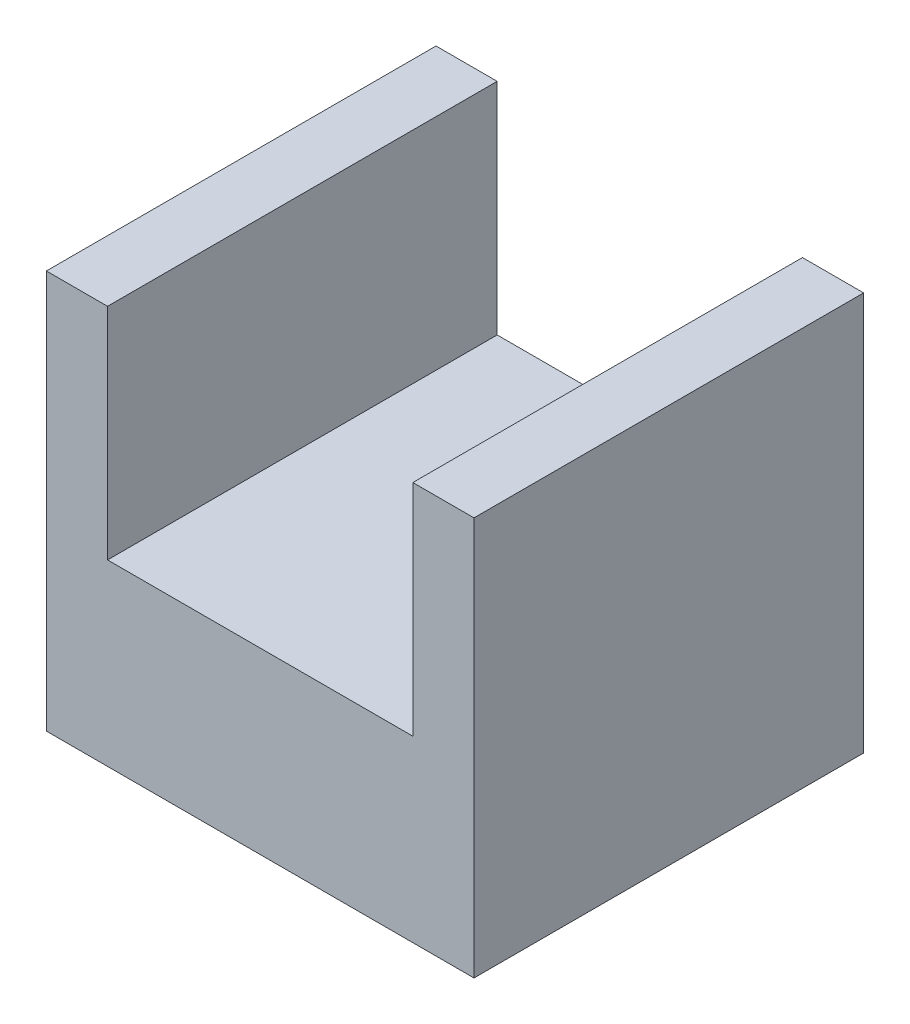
ISO-10303-21;
HEADER;
FILE_DESCRIPTION(('STEP AP214'),'2;1');
FILE_NAME('part.step','',(''),(''),'','','');
FILE_SCHEMA(('AUTOMOTIVE_DESIGN { 1 0 10303 214 1 1 1 1 }'));
ENDSEC;
DATA;
#1=APPLICATION_CONTEXT('core data for automotive mechanical design processes');
#2=APPLICATION_PROTOCOL_DEFINITION('international standard','automotive_design',2000,#1);
#3=PRODUCT_CONTEXT('',#1,'mechanical');
#4=PRODUCT('Part','Part','',(#3));
#5=PRODUCT_RELATED_PRODUCT_CATEGORY('part','',(#4));
#6=PRODUCT_DEFINITION_FORMATION('','',#4);
#7=PRODUCT_DEFINITION_CONTEXT('part definition',#1,'design');
#8=PRODUCT_DEFINITION('design','',#6,#7);
#9=PRODUCT_DEFINITION_SHAPE('','',#8);
#10=(LENGTH_UNIT() NAMED_UNIT(*) SI_UNIT(.MILLI.,.METRE.));
#11=(NAMED_UNIT(*) PLANE_ANGLE_UNIT() SI_UNIT($,.RADIAN.));
#12=(NAMED_UNIT(*) SI_UNIT($,.STERADIAN.) SOLID_ANGLE_UNIT());
#13=UNCERTAINTY_MEASURE_WITH_UNIT(LENGTH_MEASURE(1.E-05),#10,'distance_accuracy_value','');
#14=(GEOMETRIC_REPRESENTATION_CONTEXT(3) GLOBAL_UNCERTAINTY_ASSIGNED_CONTEXT((#13)) GLOBAL_UNIT_ASSIGNED_CONTEXT((#10,
#11,#12)) REPRESENTATION_CONTEXT('',''));
#15=CARTESIAN_POINT('',(0.,0.,0.));
#16=DIRECTION('',(0.,0.,1.));
#17=DIRECTION('',(1.,0.,0.));
#18=AXIS2_PLACEMENT_3D('',#15,#16,#17);
#19=CARTESIAN_POINT('',(21.95,20.455,20.));
#20=DIRECTION('',(0.,-1.,0.));
#21=DIRECTION('',(1.,0.,0.));
#22=AXIS2_PLACEMENT_3D('',#19,#20,#21);
#23=PLANE('',#22);
#24=DIRECTION('',(-1.,0.,0.));
#25=VECTOR('',#24,1.);
#26=CARTESIAN_POINT('',(21.95,20.455,-20.));
#27=LINE('',#26,#25);
#28=CARTESIAN_POINT('',(21.95,20.455,-20.));
#29=VERTEX_POINT('',#28);
#30=CARTESIAN_POINT('',(15.67,20.455,-20.));
#31=VERTEX_POINT('',#30);
#32=EDGE_CURVE('E142',#29,#31,#27,.T.);
#33=ORIENTED_EDGE('',*,*,#32,.T.);
#34=DIRECTION('',(0.,0.,1.));
#35=VECTOR('',#34,1.);
#36=CARTESIAN_POINT('',(15.67,20.455,-20.001));
#37=LINE('',#36,#35);
#38=CARTESIAN_POINT('',(15.67,20.455,20.));
#39=VERTEX_POINT('',#38);
#40=EDGE_CURVE('E126',#31,#39,#37,.T.);
#41=ORIENTED_EDGE('',*,*,#40,.T.);
#42=DIRECTION('',(-1.,0.,0.));
#43=VECTOR('',#42,1.);
#44=CARTESIAN_POINT('',(21.95,20.455,20.));
#45=LINE('',#44,#43);
#46=CARTESIAN_POINT('',(21.95,20.455,20.));
#47=VERTEX_POINT('',#46);
#48=EDGE_CURVE('E155',#47,#39,#45,.T.);
#49=ORIENTED_EDGE('',*,*,#48,.F.);
#50=DIRECTION('',(0.,0.,-1.));
#51=VECTOR('',#50,1.);
#52=CARTESIAN_POINT('',(21.95,20.455,20.));
#53=LINE('',#52,#51);
#54=EDGE_CURVE('E53',#47,#29,#53,.T.);
#55=ORIENTED_EDGE('',*,*,#54,.T.);
#56=EDGE_LOOP('',(#33,#41,#49,#55));
#57=FACE_BOUND('',#56,.T.);
#58=ADVANCED_FACE('F44',(#57),#23,.F.);
#59=CARTESIAN_POINT('',(21.95,-20.455,20.));
#60=DIRECTION('',(0.,-1.,0.));
#61=DIRECTION('',(1.,0.,0.));
#62=AXIS2_PLACEMENT_3D('',#59,#60,#61);
#63=PLANE('',#62);
#64=DIRECTION('',(-1.,0.,0.));
#65=VECTOR('',#64,1.);
#66=CARTESIAN_POINT('',(21.95,-20.455,-20.));
#67=LINE('',#66,#65);
#68=CARTESIAN_POINT('',(21.95,-20.455,-20.));
#69=VERTEX_POINT('',#68);
#70=CARTESIAN_POINT('',(-21.95,-20.455,-20.));
#71=VERTEX_POINT('',#70);
#72=EDGE_CURVE('E125',#69,#71,#67,.T.);
#73=ORIENTED_EDGE('',*,*,#72,.F.);
#74=DIRECTION('',(0.,0.,-1.));
#75=VECTOR('',#74,1.);
#76=CARTESIAN_POINT('',(21.95,-20.455,20.));
#77=LINE('',#76,#75);
#78=CARTESIAN_POINT('',(21.95,-20.455,20.));
#79=VERTEX_POINT('',#78);
#80=EDGE_CURVE('E11',#79,#69,#77,.T.);
#81=ORIENTED_EDGE('',*,*,#80,.F.);
#82=DIRECTION('',(-1.,0.,0.));
#83=VECTOR('',#82,1.);
#84=CARTESIAN_POINT('',(21.95,-20.455,20.));
#85=LINE('',#84,#83);
#86=CARTESIAN_POINT('',(-21.95,-20.455,20.));
#87=VERTEX_POINT('',#86);
#88=EDGE_CURVE('E150',#79,#87,#85,.T.);
#89=ORIENTED_EDGE('',*,*,#88,.T.);
#90=DIRECTION('',(0.,0.,-1.));
#91=VECTOR('',#90,1.);
#92=CARTESIAN_POINT('',(-21.95,-20.455,20.));
#93=LINE('',#92,#91);
#94=EDGE_CURVE('E48',#87,#71,#93,.T.);
#95=ORIENTED_EDGE('',*,*,#94,.T.);
#96=EDGE_LOOP('',(#73,#81,#89,#95));
#97=FACE_BOUND('',#96,.T.);
#98=ADVANCED_FACE('F46',(#97),#63,.T.);
#99=CARTESIAN_POINT('',(21.95,20.455,20.));
#100=DIRECTION('',(1.,0.,0.));
#101=DIRECTION('',(0.,1.,0.));
#102=AXIS2_PLACEMENT_3D('',#99,#100,#101);
#103=PLANE('',#102);
#104=DIRECTION('',(0.,-1.,0.));
#105=VECTOR('',#104,1.);
#106=CARTESIAN_POINT('',(21.95,20.455,-20.));
#107=LINE('',#106,#105);
#108=EDGE_CURVE('E145',#29,#69,#107,.T.);
#109=ORIENTED_EDGE('',*,*,#108,.F.);
#110=ORIENTED_EDGE('',*,*,#54,.F.);
#111=DIRECTION('',(0.,-1.,0.));
#112=VECTOR('',#111,1.);
#113=CARTESIAN_POINT('',(21.95,20.455,20.));
#114=LINE('',#113,#112);
#115=EDGE_CURVE('E154',#47,#79,#114,.T.);
#116=ORIENTED_EDGE('',*,*,#115,.T.);
#117=ORIENTED_EDGE('',*,*,#80,.T.);
#118=EDGE_LOOP('',(#109,#110,#116,#117));
#119=FACE_BOUND('',#118,.T.);
#120=ADVANCED_FACE('F163',(#119),#103,.T.);
#121=CARTESIAN_POINT('',(-15.67,20.455,20.));
#122=VERTEX_POINT('',#121);
#123=CARTESIAN_POINT('',(-21.95,20.455,20.));
#124=VERTEX_POINT('',#123);
#125=EDGE_CURVE('E134',#122,#124,#45,.T.);
#126=ORIENTED_EDGE('',*,*,#125,.F.);
#127=DIRECTION('',(0.,0.,1.));
#128=VECTOR('',#127,1.);
#129=CARTESIAN_POINT('',(-15.67,20.455,-20.001));
#130=LINE('',#129,#128);
#131=CARTESIAN_POINT('',(-15.67,20.455,-20.));
#132=VERTEX_POINT('',#131);
#133=EDGE_CURVE('E120',#132,#122,#130,.T.);
#134=ORIENTED_EDGE('',*,*,#133,.F.);
#135=CARTESIAN_POINT('',(-21.95,20.455,-20.));
#136=VERTEX_POINT('',#135);
#137=EDGE_CURVE('E132',#132,#136,#27,.T.);
#138=ORIENTED_EDGE('',*,*,#137,.T.);
#139=DIRECTION('',(0.,0.,-1.));
#140=VECTOR('',#139,1.);
#141=CARTESIAN_POINT('',(-21.95,20.455,20.));
#142=LINE('',#141,#140);
#143=EDGE_CURVE('E152',#124,#136,#142,.T.);
#144=ORIENTED_EDGE('',*,*,#143,.F.);
#145=EDGE_LOOP('',(#126,#134,#138,#144));
#146=FACE_BOUND('',#145,.T.);
#147=ADVANCED_FACE('F130',(#146),#23,.F.);
#148=CARTESIAN_POINT('',(-21.95,20.455,20.));
#149=DIRECTION('',(1.,0.,0.));
#150=DIRECTION('',(0.,1.,0.));
#151=AXIS2_PLACEMENT_3D('',#148,#149,#150);
#152=PLANE('',#151);
#153=DIRECTION('',(0.,-1.,0.));
#154=VECTOR('',#153,1.);
#155=CARTESIAN_POINT('',(-21.95,20.455,-20.));
#156=LINE('',#155,#154);
#157=EDGE_CURVE('E141',#136,#71,#156,.T.);
#158=ORIENTED_EDGE('',*,*,#157,.T.);
#159=ORIENTED_EDGE('',*,*,#94,.F.);
#160=DIRECTION('',(0.,-1.,0.));
#161=VECTOR('',#160,1.);
#162=CARTESIAN_POINT('',(-21.95,20.455,20.));
#163=LINE('',#162,#161);
#164=EDGE_CURVE('E94',#124,#87,#163,.T.);
#165=ORIENTED_EDGE('',*,*,#164,.F.);
#166=ORIENTED_EDGE('',*,*,#143,.T.);
#167=EDGE_LOOP('',(#158,#159,#165,#166));
#168=FACE_BOUND('',#167,.T.);
#169=ADVANCED_FACE('F175',(#168),#152,.F.);
#170=CARTESIAN_POINT('',(0.,0.,20.));
#171=DIRECTION('',(0.,0.,1.));
#172=DIRECTION('',(1.,0.,0.));
#173=AXIS2_PLACEMENT_3D('',#170,#171,#172);
#174=PLANE('',#173);
#175=DIRECTION('',(0.,1.,0.));
#176=VECTOR('',#175,1.);
#177=CARTESIAN_POINT('',(15.67,20.455,20.));
#178=LINE('',#177,#176);
#179=CARTESIAN_POINT('',(15.67,-2.09500000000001,20.));
#180=VERTEX_POINT('',#179);
#181=EDGE_CURVE('E135',#180,#39,#178,.T.);
#182=ORIENTED_EDGE('',*,*,#181,.F.);
#183=DIRECTION('',(1.,0.,0.));
#184=VECTOR('',#183,1.);
#185=CARTESIAN_POINT('',(-15.67,-2.09500000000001,20.));
#186=LINE('',#185,#184);
#187=CARTESIAN_POINT('',(-15.67,-2.09500000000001,20.));
#188=VERTEX_POINT('',#187);
#189=EDGE_CURVE('E191',#188,#180,#186,.T.);
#190=ORIENTED_EDGE('',*,*,#189,.F.);
#191=DIRECTION('',(0.,-1.,0.));
#192=VECTOR('',#191,1.);
#193=CARTESIAN_POINT('',(-15.67,20.455,20.));
#194=LINE('',#193,#192);
#195=EDGE_CURVE('E194',#122,#188,#194,.T.);
#196=ORIENTED_EDGE('',*,*,#195,.F.);
#197=ORIENTED_EDGE('',*,*,#125,.T.);
#198=ORIENTED_EDGE('',*,*,#164,.T.);
#199=ORIENTED_EDGE('',*,*,#88,.F.);
#200=ORIENTED_EDGE('',*,*,#115,.F.);
#201=ORIENTED_EDGE('',*,*,#48,.T.);
#202=EDGE_LOOP('',(#182,#190,#196,#197,#198,#199,#200,#201));
#203=FACE_BOUND('',#202,.T.);
#204=ADVANCED_FACE('F179',(#203),#174,.T.);
#205=CARTESIAN_POINT('',(0.,0.,-20.));
#206=DIRECTION('',(0.,0.,1.));
#207=DIRECTION('',(1.,0.,0.));
#208=AXIS2_PLACEMENT_3D('',#205,#206,#207);
#209=PLANE('',#208);
#210=DIRECTION('',(-1.,0.,0.));
#211=VECTOR('',#210,1.);
#212=CARTESIAN_POINT('',(-15.67,-2.09500000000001,-20.));
#213=LINE('',#212,#211);
#214=CARTESIAN_POINT('',(15.67,-2.09500000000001,-20.));
#215=VERTEX_POINT('',#214);
#216=CARTESIAN_POINT('',(-15.67,-2.09500000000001,-20.));
#217=VERTEX_POINT('',#216);
#218=EDGE_CURVE('E61',#215,#217,#213,.T.);
#219=ORIENTED_EDGE('',*,*,#218,.F.);
#220=DIRECTION('',(0.,-1.,0.));
#221=VECTOR('',#220,1.);
#222=CARTESIAN_POINT('',(15.67,20.455,-20.));
#223=LINE('',#222,#221);
#224=EDGE_CURVE('E196',#31,#215,#223,.T.);
#225=ORIENTED_EDGE('',*,*,#224,.F.);
#226=ORIENTED_EDGE('',*,*,#32,.F.);
#227=ORIENTED_EDGE('',*,*,#108,.T.);
#228=ORIENTED_EDGE('',*,*,#72,.T.);
#229=ORIENTED_EDGE('',*,*,#157,.F.);
#230=ORIENTED_EDGE('',*,*,#137,.F.);
#231=DIRECTION('',(0.,1.,0.));
#232=VECTOR('',#231,1.);
#233=CARTESIAN_POINT('',(-15.67,20.455,-20.));
#234=LINE('',#233,#232);
#235=EDGE_CURVE('E116',#217,#132,#234,.T.);
#236=ORIENTED_EDGE('',*,*,#235,.F.);
#237=EDGE_LOOP('',(#219,#225,#226,#227,#228,#229,#230,#236));
#238=FACE_BOUND('',#237,.T.);
#239=ADVANCED_FACE('F138',(#238),#209,.F.);
#240=CARTESIAN_POINT('',(15.67,20.455,-20.001));
#241=DIRECTION('',(1.,0.,0.));
#242=DIRECTION('',(0.,1.,0.));
#243=AXIS2_PLACEMENT_3D('',#240,#241,#242);
#244=PLANE('',#243);
#245=ORIENTED_EDGE('',*,*,#224,.T.);
#246=DIRECTION('',(0.,0.,1.));
#247=VECTOR('',#246,1.);
#248=CARTESIAN_POINT('',(15.67,-2.09500000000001,-20.001));
#249=LINE('',#248,#247);
#250=EDGE_CURVE('E186',#215,#180,#249,.T.);
#251=ORIENTED_EDGE('',*,*,#250,.T.);
#252=ORIENTED_EDGE('',*,*,#181,.T.);
#253=ORIENTED_EDGE('',*,*,#40,.F.);
#254=EDGE_LOOP('',(#245,#251,#252,#253));
#255=FACE_BOUND('',#254,.T.);
#256=ADVANCED_FACE('F201',(#255),#244,.F.);
#257=CARTESIAN_POINT('',(-15.67,-2.09500000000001,-20.001));
#258=DIRECTION('',(0.,-1.,0.));
#259=DIRECTION('',(0.,0.,-1.));
#260=AXIS2_PLACEMENT_3D('',#257,#258,#259);
#261=PLANE('',#260);
#262=ORIENTED_EDGE('',*,*,#218,.T.);
#263=DIRECTION('',(0.,0.,1.));
#264=VECTOR('',#263,1.);
#265=CARTESIAN_POINT('',(-15.67,-2.09500000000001,-20.001));
#266=LINE('',#265,#264);
#267=EDGE_CURVE('E122',#217,#188,#266,.T.);
#268=ORIENTED_EDGE('',*,*,#267,.T.);
#269=ORIENTED_EDGE('',*,*,#189,.T.);
#270=ORIENTED_EDGE('',*,*,#250,.F.);
#271=EDGE_LOOP('',(#262,#268,#269,#270));
#272=FACE_BOUND('',#271,.T.);
#273=ADVANCED_FACE('F205',(#272),#261,.F.);
#274=CARTESIAN_POINT('',(-15.67,20.455,-20.001));
#275=DIRECTION('',(-1.,0.,0.));
#276=DIRECTION('',(0.,-1.,0.));
#277=AXIS2_PLACEMENT_3D('',#274,#275,#276);
#278=PLANE('',#277);
#279=ORIENTED_EDGE('',*,*,#235,.T.);
#280=ORIENTED_EDGE('',*,*,#133,.T.);
#281=ORIENTED_EDGE('',*,*,#195,.T.);
#282=ORIENTED_EDGE('',*,*,#267,.F.);
#283=EDGE_LOOP('',(#279,#280,#281,#282));
#284=FACE_BOUND('',#283,.T.);
#285=ADVANCED_FACE('F118',(#284),#278,.F.);
#286=CLOSED_SHELL('',(#58,#98,#120,#147,#169,#204,#239,#256,#273,#285));
#287=MANIFOLD_SOLID_BREP('B2',#286);
#288=ADVANCED_BREP_SHAPE_REPRESENTATION('',(#18,#287),#14);
#289=SHAPE_DEFINITION_REPRESENTATION(#9,#288);
ENDSEC;
END-ISO-10303-21;
